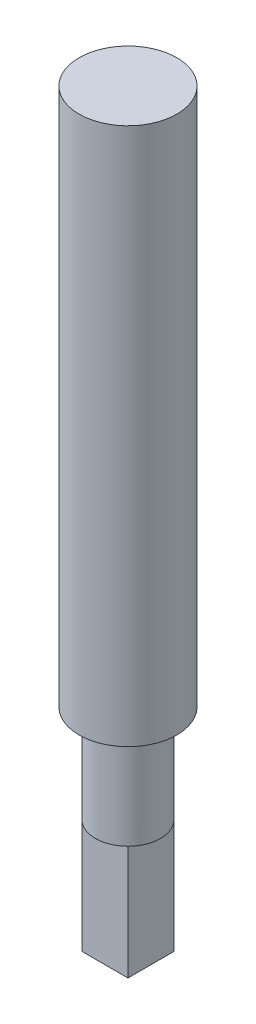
ISO-10303-21;
HEADER;
FILE_DESCRIPTION(('STEP AP214'),'2;1');
FILE_NAME('part.step','',(''),(''),'','','');
FILE_SCHEMA(('AUTOMOTIVE_DESIGN { 1 0 10303 214 1 1 1 1 }'));
ENDSEC;
DATA;
#1=APPLICATION_CONTEXT('core data for automotive mechanical design processes');
#2=APPLICATION_PROTOCOL_DEFINITION('international standard','automotive_design',2000,#1);
#3=PRODUCT_CONTEXT('',#1,'mechanical');
#4=PRODUCT('Part','Part','',(#3));
#5=PRODUCT_RELATED_PRODUCT_CATEGORY('part','',(#4));
#6=PRODUCT_DEFINITION_FORMATION('','',#4);
#7=PRODUCT_DEFINITION_CONTEXT('part definition',#1,'design');
#8=PRODUCT_DEFINITION('design','',#6,#7);
#9=PRODUCT_DEFINITION_SHAPE('','',#8);
#10=(LENGTH_UNIT() NAMED_UNIT(*) SI_UNIT(.MILLI.,.METRE.));
#11=(NAMED_UNIT(*) PLANE_ANGLE_UNIT() SI_UNIT($,.RADIAN.));
#12=(NAMED_UNIT(*) SI_UNIT($,.STERADIAN.) SOLID_ANGLE_UNIT());
#13=UNCERTAINTY_MEASURE_WITH_UNIT(LENGTH_MEASURE(1.E-05),#10,'distance_accuracy_value','');
#14=(GEOMETRIC_REPRESENTATION_CONTEXT(3) GLOBAL_UNCERTAINTY_ASSIGNED_CONTEXT((#13)) GLOBAL_UNIT_ASSIGNED_CONTEXT((#10,
#11,#12)) REPRESENTATION_CONTEXT('',''));
#15=CARTESIAN_POINT('',(0.,0.,0.));
#16=DIRECTION('',(0.,0.,1.));
#17=DIRECTION('',(1.,0.,0.));
#18=AXIS2_PLACEMENT_3D('',#15,#16,#17);
#19=CARTESIAN_POINT('',(1.50000000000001,-6.5,0.));
#20=DIRECTION('',(0.,1.,0.));
#21=DIRECTION('',(0.,0.,1.));
#22=AXIS2_PLACEMENT_3D('',#19,#20,#21);
#23=CYLINDRICAL_SURFACE('',#22,1.);
#24=CARTESIAN_POINT('',(1.50000000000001,0.,0.));
#25=DIRECTION('',(0.,1.,0.));
#26=DIRECTION('',(0.,0.,1.));
#27=AXIS2_PLACEMENT_3D('',#24,#25,#26);
#28=CIRCLE('',#27,1.);
#29=CARTESIAN_POINT('',(1.50000000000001,0.,0.999999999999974));
#30=VERTEX_POINT('',#29);
#31=EDGE_CURVE('E11',#30,#30,#28,.F.);
#32=ORIENTED_EDGE('',*,*,#31,.T.);
#33=EDGE_LOOP('',(#32));
#34=FACE_BOUND('',#33,.T.);
#35=CARTESIAN_POINT('',(1.50000000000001,-3.,0.));
#36=DIRECTION('',(0.,-1.,0.));
#37=DIRECTION('',(0.,0.,-1.));
#38=AXIS2_PLACEMENT_3D('',#35,#36,#37);
#39=CIRCLE('',#38,1.);
#40=CARTESIAN_POINT('',(2.20710678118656,-3.,-0.707106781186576));
#41=VERTEX_POINT('',#40);
#42=CARTESIAN_POINT('',(2.20710678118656,-3.,0.707106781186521));
#43=VERTEX_POINT('',#42);
#44=EDGE_CURVE('E119',#41,#43,#39,.T.);
#45=ORIENTED_EDGE('',*,*,#44,.F.);
#46=CARTESIAN_POINT('',(1.50000000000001,-3.,0.));
#47=DIRECTION('',(0.,-1.,0.));
#48=DIRECTION('',(0.,0.,-1.));
#49=AXIS2_PLACEMENT_3D('',#46,#47,#48);
#50=CIRCLE('',#49,1.);
#51=CARTESIAN_POINT('',(0.79289321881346,-3.,-0.707106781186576));
#52=VERTEX_POINT('',#51);
#53=EDGE_CURVE('E127',#52,#41,#50,.T.);
#54=ORIENTED_EDGE('',*,*,#53,.F.);
#55=CARTESIAN_POINT('',(1.50000000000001,-3.,0.));
#56=DIRECTION('',(0.,-1.,0.));
#57=DIRECTION('',(0.,0.,-1.));
#58=AXIS2_PLACEMENT_3D('',#55,#56,#57);
#59=CIRCLE('',#58,1.);
#60=CARTESIAN_POINT('',(0.79289321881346,-3.,0.707106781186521));
#61=VERTEX_POINT('',#60);
#62=EDGE_CURVE('E356',#61,#52,#59,.T.);
#63=ORIENTED_EDGE('',*,*,#62,.F.);
#64=CARTESIAN_POINT('',(1.50000000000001,-3.,0.));
#65=DIRECTION('',(0.,-1.,0.));
#66=DIRECTION('',(0.,0.,-1.));
#67=AXIS2_PLACEMENT_3D('',#64,#65,#66);
#68=CIRCLE('',#67,1.);
#69=EDGE_CURVE('E128',#43,#61,#68,.T.);
#70=ORIENTED_EDGE('',*,*,#69,.F.);
#71=EDGE_LOOP('',(#45,#54,#63,#70));
#72=FACE_BOUND('',#71,.T.);
#73=ADVANCED_FACE('F36',(#34,#72),#23,.T.);
#74=CARTESIAN_POINT('',(1.50000000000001,-6.5,0.));
#75=DIRECTION('',(0.,-1.,0.));
#76=DIRECTION('',(0.,0.,-1.));
#77=AXIS2_PLACEMENT_3D('',#74,#75,#76);
#78=PLANE('',#77);
#79=DIRECTION('',(-1.,0.,0.));
#80=VECTOR('',#79,1.);
#81=CARTESIAN_POINT('',(0.,-6.5,-0.707106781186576));
#82=LINE('',#81,#80);
#83=CARTESIAN_POINT('',(2.20710678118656,-6.5,-0.707106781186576));
#84=VERTEX_POINT('',#83);
#85=CARTESIAN_POINT('',(0.79289321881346,-6.5,-0.707106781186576));
#86=VERTEX_POINT('',#85);
#87=EDGE_CURVE('E133',#84,#86,#82,.T.);
#88=ORIENTED_EDGE('',*,*,#87,.F.);
#89=DIRECTION('',(0.,0.,1.));
#90=VECTOR('',#89,1.);
#91=CARTESIAN_POINT('',(2.20710678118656,-6.5,0.));
#92=LINE('',#91,#90);
#93=CARTESIAN_POINT('',(2.20710678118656,-6.5,0.707106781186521));
#94=VERTEX_POINT('',#93);
#95=EDGE_CURVE('E108',#84,#94,#92,.T.);
#96=ORIENTED_EDGE('',*,*,#95,.T.);
#97=DIRECTION('',(-1.,0.,0.));
#98=VECTOR('',#97,1.);
#99=CARTESIAN_POINT('',(0.,-6.5,0.707106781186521));
#100=LINE('',#99,#98);
#101=CARTESIAN_POINT('',(0.79289321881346,-6.5,0.707106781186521));
#102=VERTEX_POINT('',#101);
#103=EDGE_CURVE('E120',#94,#102,#100,.T.);
#104=ORIENTED_EDGE('',*,*,#103,.T.);
#105=DIRECTION('',(0.,0.,1.));
#106=VECTOR('',#105,1.);
#107=CARTESIAN_POINT('',(0.79289321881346,-6.5,0.));
#108=LINE('',#107,#106);
#109=EDGE_CURVE('E141',#86,#102,#108,.T.);
#110=ORIENTED_EDGE('',*,*,#109,.F.);
#111=EDGE_LOOP('',(#88,#96,#104,#110));
#112=FACE_BOUND('',#111,.T.);
#113=ADVANCED_FACE('F199',(#112),#78,.T.);
#114=CARTESIAN_POINT('',(1.5,0.,0.));
#115=DIRECTION('',(0.,1.,0.));
#116=DIRECTION('',(0.,0.,1.));
#117=AXIS2_PLACEMENT_3D('',#114,#115,#116);
#118=PLANE('',#117);
#119=CARTESIAN_POINT('',(1.5,0.,0.));
#120=DIRECTION('',(0.,1.,0.));
#121=DIRECTION('',(0.,0.,1.));
#122=AXIS2_PLACEMENT_3D('',#119,#120,#121);
#123=CIRCLE('',#122,1.5);
#124=CARTESIAN_POINT('',(1.5,0.,1.5));
#125=VERTEX_POINT('',#124);
#126=EDGE_CURVE('E156',#125,#125,#123,.T.);
#127=ORIENTED_EDGE('',*,*,#126,.F.);
#128=EDGE_LOOP('',(#127));
#129=FACE_BOUND('',#128,.T.);
#130=ORIENTED_EDGE('',*,*,#31,.F.);
#131=EDGE_LOOP('',(#130));
#132=FACE_BOUND('',#131,.T.);
#133=ADVANCED_FACE('F206',(#129,#132),#118,.F.);
#134=CARTESIAN_POINT('',(1.5,16.5,0.));
#135=DIRECTION('',(0.,-1.,0.));
#136=DIRECTION('',(0.,0.,-1.));
#137=AXIS2_PLACEMENT_3D('',#134,#135,#136);
#138=CYLINDRICAL_SURFACE('',#137,1.5);
#139=ORIENTED_EDGE('',*,*,#126,.T.);
#140=EDGE_LOOP('',(#139));
#141=FACE_BOUND('',#140,.T.);
#142=CARTESIAN_POINT('',(1.5,16.5,0.));
#143=DIRECTION('',(0.,1.,0.));
#144=DIRECTION('',(0.,0.,1.));
#145=AXIS2_PLACEMENT_3D('',#142,#143,#144);
#146=CIRCLE('',#145,1.5);
#147=CARTESIAN_POINT('',(1.5,16.5,1.5));
#148=VERTEX_POINT('',#147);
#149=EDGE_CURVE('E163',#148,#148,#146,.T.);
#150=ORIENTED_EDGE('',*,*,#149,.F.);
#151=EDGE_LOOP('',(#150));
#152=FACE_BOUND('',#151,.T.);
#153=CARTESIAN_POINT('',(1.5,7.50000000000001,0.));
#154=DIRECTION('',(0.,-1.,0.));
#155=DIRECTION('',(0.,0.,-1.));
#156=AXIS2_PLACEMENT_3D('',#153,#154,#155);
#157=CIRCLE('',#156,1.5);
#158=CARTESIAN_POINT('',(0.0857864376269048,7.50000000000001,0.5));
#159=VERTEX_POINT('',#158);
#160=CARTESIAN_POINT('',(0.0857864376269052,7.50000000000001,-0.5));
#161=VERTEX_POINT('',#160);
#162=EDGE_CURVE('E166',#159,#161,#157,.T.);
#163=ORIENTED_EDGE('',*,*,#162,.F.);
#164=DIRECTION('',(0.,-1.,0.));
#165=VECTOR('',#164,1.);
#166=CARTESIAN_POINT('',(0.0857864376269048,16.5,0.5));
#167=LINE('',#166,#165);
#168=CARTESIAN_POINT('',(0.0857864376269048,4.5,0.5));
#169=VERTEX_POINT('',#168);
#170=EDGE_CURVE('E44',#159,#169,#167,.T.);
#171=ORIENTED_EDGE('',*,*,#170,.T.);
#172=CARTESIAN_POINT('',(1.5,4.5,0.));
#173=DIRECTION('',(0.,-1.,0.));
#174=DIRECTION('',(0.,0.,-1.));
#175=AXIS2_PLACEMENT_3D('',#172,#173,#174);
#176=CIRCLE('',#175,1.5);
#177=CARTESIAN_POINT('',(0.0857864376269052,4.5,-0.5));
#178=VERTEX_POINT('',#177);
#179=EDGE_CURVE('E51',#169,#178,#176,.T.);
#180=ORIENTED_EDGE('',*,*,#179,.T.);
#181=DIRECTION('',(0.,-1.,0.));
#182=VECTOR('',#181,1.);
#183=CARTESIAN_POINT('',(0.0857864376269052,16.5,-0.5));
#184=LINE('',#183,#182);
#185=EDGE_CURVE('E59',#161,#178,#184,.T.);
#186=ORIENTED_EDGE('',*,*,#185,.F.);
#187=EDGE_LOOP('',(#163,#171,#180,#186));
#188=FACE_BOUND('',#187,.T.);
#189=ADVANCED_FACE('F38',(#141,#152,#188),#138,.T.);
#190=CARTESIAN_POINT('',(1.5,16.5,0.));
#191=DIRECTION('',(0.,1.,0.));
#192=DIRECTION('',(0.,0.,1.));
#193=AXIS2_PLACEMENT_3D('',#190,#191,#192);
#194=PLANE('',#193);
#195=ORIENTED_EDGE('',*,*,#149,.T.);
#196=EDGE_LOOP('',(#195));
#197=FACE_BOUND('',#196,.T.);
#198=ADVANCED_FACE('F195',(#197),#194,.T.);
#199=CARTESIAN_POINT('',(1.,4.5,-0.5));
#200=DIRECTION('',(0.,-1.,0.));
#201=DIRECTION('',(0.,0.,-1.));
#202=AXIS2_PLACEMENT_3D('',#199,#200,#201);
#203=PLANE('',#202);
#204=DIRECTION('',(-1.,0.,0.));
#205=VECTOR('',#204,1.);
#206=CARTESIAN_POINT('',(1.,4.5,0.5));
#207=LINE('',#206,#205);
#208=CARTESIAN_POINT('',(1.,4.5,0.5));
#209=VERTEX_POINT('',#208);
#210=EDGE_CURVE('E153',#209,#169,#207,.T.);
#211=ORIENTED_EDGE('',*,*,#210,.F.);
#212=DIRECTION('',(0.,0.,1.));
#213=VECTOR('',#212,1.);
#214=CARTESIAN_POINT('',(1.,4.5,-0.5));
#215=LINE('',#214,#213);
#216=CARTESIAN_POINT('',(1.,4.5,-0.5));
#217=VERTEX_POINT('',#216);
#218=EDGE_CURVE('E142',#217,#209,#215,.T.);
#219=ORIENTED_EDGE('',*,*,#218,.F.);
#220=DIRECTION('',(-1.,0.,0.));
#221=VECTOR('',#220,1.);
#222=CARTESIAN_POINT('',(1.,4.5,-0.5));
#223=LINE('',#222,#221);
#224=EDGE_CURVE('E154',#217,#178,#223,.T.);
#225=ORIENTED_EDGE('',*,*,#224,.T.);
#226=ORIENTED_EDGE('',*,*,#179,.F.);
#227=EDGE_LOOP('',(#211,#219,#225,#226));
#228=FACE_BOUND('',#227,.T.);
#229=ADVANCED_FACE('F186',(#228),#203,.F.);
#230=CARTESIAN_POINT('',(1.,4.5,-0.5));
#231=DIRECTION('',(0.,0.,1.));
#232=DIRECTION('',(1.,0.,0.));
#233=AXIS2_PLACEMENT_3D('',#230,#231,#232);
#234=PLANE('',#233);
#235=ORIENTED_EDGE('',*,*,#185,.T.);
#236=ORIENTED_EDGE('',*,*,#224,.F.);
#237=DIRECTION('',(0.,1.,0.));
#238=VECTOR('',#237,1.);
#239=CARTESIAN_POINT('',(1.,4.5,-0.5));
#240=LINE('',#239,#238);
#241=CARTESIAN_POINT('',(1.,7.50000000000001,-0.5));
#242=VERTEX_POINT('',#241);
#243=EDGE_CURVE('E151',#217,#242,#240,.T.);
#244=ORIENTED_EDGE('',*,*,#243,.T.);
#245=DIRECTION('',(-1.,0.,0.));
#246=VECTOR('',#245,1.);
#247=CARTESIAN_POINT('',(1.,7.50000000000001,-0.5));
#248=LINE('',#247,#246);
#249=EDGE_CURVE('E157',#242,#161,#248,.T.);
#250=ORIENTED_EDGE('',*,*,#249,.T.);
#251=EDGE_LOOP('',(#235,#236,#244,#250));
#252=FACE_BOUND('',#251,.T.);
#253=ADVANCED_FACE('F187',(#252),#234,.T.);
#254=CARTESIAN_POINT('',(1.,7.50000000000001,-0.5));
#255=DIRECTION('',(0.,-1.,0.));
#256=DIRECTION('',(0.,0.,-1.));
#257=AXIS2_PLACEMENT_3D('',#254,#255,#256);
#258=PLANE('',#257);
#259=DIRECTION('',(-1.,0.,0.));
#260=VECTOR('',#259,1.);
#261=CARTESIAN_POINT('',(1.,7.50000000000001,0.5));
#262=LINE('',#261,#260);
#263=CARTESIAN_POINT('',(1.,7.50000000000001,0.5));
#264=VERTEX_POINT('',#263);
#265=EDGE_CURVE('E159',#264,#159,#262,.T.);
#266=ORIENTED_EDGE('',*,*,#265,.T.);
#267=ORIENTED_EDGE('',*,*,#162,.T.);
#268=ORIENTED_EDGE('',*,*,#249,.F.);
#269=DIRECTION('',(0.,0.,1.));
#270=VECTOR('',#269,1.);
#271=CARTESIAN_POINT('',(1.,7.50000000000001,-0.5));
#272=LINE('',#271,#270);
#273=EDGE_CURVE('E149',#242,#264,#272,.T.);
#274=ORIENTED_EDGE('',*,*,#273,.T.);
#275=EDGE_LOOP('',(#266,#267,#268,#274));
#276=FACE_BOUND('',#275,.T.);
#277=ADVANCED_FACE('F179',(#276),#258,.T.);
#278=CARTESIAN_POINT('',(1.,4.5,0.5));
#279=DIRECTION('',(0.,0.,1.));
#280=DIRECTION('',(1.,0.,0.));
#281=AXIS2_PLACEMENT_3D('',#278,#279,#280);
#282=PLANE('',#281);
#283=ORIENTED_EDGE('',*,*,#265,.F.);
#284=DIRECTION('',(0.,1.,0.));
#285=VECTOR('',#284,1.);
#286=CARTESIAN_POINT('',(1.,4.5,0.5));
#287=LINE('',#286,#285);
#288=EDGE_CURVE('E146',#209,#264,#287,.T.);
#289=ORIENTED_EDGE('',*,*,#288,.F.);
#290=ORIENTED_EDGE('',*,*,#210,.T.);
#291=ORIENTED_EDGE('',*,*,#170,.F.);
#292=EDGE_LOOP('',(#283,#289,#290,#291));
#293=FACE_BOUND('',#292,.T.);
#294=ADVANCED_FACE('F176',(#293),#282,.F.);
#295=CARTESIAN_POINT('',(1.,0.,0.));
#296=DIRECTION('',(-1.,0.,0.));
#297=DIRECTION('',(0.,0.,1.));
#298=AXIS2_PLACEMENT_3D('',#295,#296,#297);
#299=PLANE('',#298);
#300=ORIENTED_EDGE('',*,*,#218,.T.);
#301=ORIENTED_EDGE('',*,*,#288,.T.);
#302=ORIENTED_EDGE('',*,*,#273,.F.);
#303=ORIENTED_EDGE('',*,*,#243,.F.);
#304=EDGE_LOOP('',(#300,#301,#302,#303));
#305=FACE_BOUND('',#304,.T.);
#306=ADVANCED_FACE('F184',(#305),#299,.T.);
#307=CARTESIAN_POINT('',(0.,-3.,-0.707106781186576));
#308=DIRECTION('',(0.,0.,1.));
#309=DIRECTION('',(1.,0.,0.));
#310=AXIS2_PLACEMENT_3D('',#307,#308,#309);
#311=PLANE('',#310);
#312=ORIENTED_EDGE('',*,*,#87,.T.);
#313=DIRECTION('',(0.,-1.,0.));
#314=VECTOR('',#313,1.);
#315=CARTESIAN_POINT('',(0.79289321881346,-3.,-0.707106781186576));
#316=LINE('',#315,#314);
#317=EDGE_CURVE('E113',#52,#86,#316,.T.);
#318=ORIENTED_EDGE('',*,*,#317,.F.);
#319=DIRECTION('',(-1.,0.,0.));
#320=VECTOR('',#319,1.);
#321=CARTESIAN_POINT('',(0.,-3.,-0.707106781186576));
#322=LINE('',#321,#320);
#323=EDGE_CURVE('E114',#41,#52,#322,.T.);
#324=ORIENTED_EDGE('',*,*,#323,.F.);
#325=DIRECTION('',(0.,-1.,0.));
#326=VECTOR('',#325,1.);
#327=CARTESIAN_POINT('',(2.20710678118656,-3.,-0.707106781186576));
#328=LINE('',#327,#326);
#329=EDGE_CURVE('E102',#41,#84,#328,.T.);
#330=ORIENTED_EDGE('',*,*,#329,.T.);
#331=EDGE_LOOP('',(#312,#318,#324,#330));
#332=FACE_BOUND('',#331,.T.);
#333=ADVANCED_FACE('F136',(#332),#311,.F.);
#334=CARTESIAN_POINT('',(0.,-3.,0.));
#335=DIRECTION('',(0.,-1.,0.));
#336=DIRECTION('',(0.,0.,-1.));
#337=AXIS2_PLACEMENT_3D('',#334,#335,#336);
#338=PLANE('',#337);
#339=ORIENTED_EDGE('',*,*,#53,.T.);
#340=ORIENTED_EDGE('',*,*,#323,.T.);
#341=EDGE_LOOP('',(#339,#340));
#342=FACE_BOUND('',#341,.T.);
#343=ADVANCED_FACE('F132',(#342),#338,.T.);
#344=CARTESIAN_POINT('',(0.79289321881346,-3.,0.));
#345=DIRECTION('',(1.,0.,0.));
#346=DIRECTION('',(0.,0.,-1.));
#347=AXIS2_PLACEMENT_3D('',#344,#345,#346);
#348=PLANE('',#347);
#349=ORIENTED_EDGE('',*,*,#109,.T.);
#350=DIRECTION('',(0.,-1.,0.));
#351=VECTOR('',#350,1.);
#352=CARTESIAN_POINT('',(0.79289321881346,-3.,0.707106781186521));
#353=LINE('',#352,#351);
#354=EDGE_CURVE('E364',#61,#102,#353,.T.);
#355=ORIENTED_EDGE('',*,*,#354,.F.);
#356=DIRECTION('',(0.,0.,1.));
#357=VECTOR('',#356,1.);
#358=CARTESIAN_POINT('',(0.79289321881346,-3.,0.));
#359=LINE('',#358,#357);
#360=EDGE_CURVE('E359',#52,#61,#359,.T.);
#361=ORIENTED_EDGE('',*,*,#360,.F.);
#362=ORIENTED_EDGE('',*,*,#317,.T.);
#363=EDGE_LOOP('',(#349,#355,#361,#362));
#364=FACE_BOUND('',#363,.T.);
#365=ADVANCED_FACE('F290',(#364),#348,.F.);
#366=CARTESIAN_POINT('',(0.,-3.,0.));
#367=DIRECTION('',(0.,-1.,0.));
#368=DIRECTION('',(0.,0.,-1.));
#369=AXIS2_PLACEMENT_3D('',#366,#367,#368);
#370=PLANE('',#369);
#371=ORIENTED_EDGE('',*,*,#62,.T.);
#372=ORIENTED_EDGE('',*,*,#360,.T.);
#373=EDGE_LOOP('',(#371,#372));
#374=FACE_BOUND('',#373,.T.);
#375=ADVANCED_FACE('F298',(#374),#370,.T.);
#376=CARTESIAN_POINT('',(0.,-3.,0.707106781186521));
#377=DIRECTION('',(0.,0.,1.));
#378=DIRECTION('',(1.,0.,0.));
#379=AXIS2_PLACEMENT_3D('',#376,#377,#378);
#380=PLANE('',#379);
#381=ORIENTED_EDGE('',*,*,#103,.F.);
#382=DIRECTION('',(0.,-1.,0.));
#383=VECTOR('',#382,1.);
#384=CARTESIAN_POINT('',(2.20710678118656,-3.,0.707106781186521));
#385=LINE('',#384,#383);
#386=EDGE_CURVE('E360',#43,#94,#385,.T.);
#387=ORIENTED_EDGE('',*,*,#386,.F.);
#388=DIRECTION('',(-1.,0.,0.));
#389=VECTOR('',#388,1.);
#390=CARTESIAN_POINT('',(0.,-3.,0.707106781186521));
#391=LINE('',#390,#389);
#392=EDGE_CURVE('E354',#43,#61,#391,.T.);
#393=ORIENTED_EDGE('',*,*,#392,.T.);
#394=ORIENTED_EDGE('',*,*,#354,.T.);
#395=EDGE_LOOP('',(#381,#387,#393,#394));
#396=FACE_BOUND('',#395,.T.);
#397=ADVANCED_FACE('F307',(#396),#380,.T.);
#398=CARTESIAN_POINT('',(0.,-3.,0.));
#399=DIRECTION('',(0.,-1.,0.));
#400=DIRECTION('',(0.,0.,-1.));
#401=AXIS2_PLACEMENT_3D('',#398,#399,#400);
#402=PLANE('',#401);
#403=ORIENTED_EDGE('',*,*,#392,.F.);
#404=ORIENTED_EDGE('',*,*,#69,.T.);
#405=EDGE_LOOP('',(#403,#404));
#406=FACE_BOUND('',#405,.T.);
#407=ADVANCED_FACE('F316',(#406),#402,.T.);
#408=CARTESIAN_POINT('',(2.20710678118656,-3.,0.));
#409=DIRECTION('',(1.,0.,0.));
#410=DIRECTION('',(0.,0.,-1.));
#411=AXIS2_PLACEMENT_3D('',#408,#409,#410);
#412=PLANE('',#411);
#413=ORIENTED_EDGE('',*,*,#95,.F.);
#414=ORIENTED_EDGE('',*,*,#329,.F.);
#415=DIRECTION('',(0.,0.,1.));
#416=VECTOR('',#415,1.);
#417=CARTESIAN_POINT('',(2.20710678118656,-3.,0.));
#418=LINE('',#417,#416);
#419=EDGE_CURVE('E105',#41,#43,#418,.T.);
#420=ORIENTED_EDGE('',*,*,#419,.T.);
#421=ORIENTED_EDGE('',*,*,#386,.T.);
#422=EDGE_LOOP('',(#413,#414,#420,#421));
#423=FACE_BOUND('',#422,.T.);
#424=ADVANCED_FACE('F104',(#423),#412,.T.);
#425=CARTESIAN_POINT('',(0.,-3.,0.));
#426=DIRECTION('',(0.,-1.,0.));
#427=DIRECTION('',(0.,0.,-1.));
#428=AXIS2_PLACEMENT_3D('',#425,#426,#427);
#429=PLANE('',#428);
#430=ORIENTED_EDGE('',*,*,#419,.F.);
#431=ORIENTED_EDGE('',*,*,#44,.T.);
#432=EDGE_LOOP('',(#430,#431));
#433=FACE_BOUND('',#432,.T.);
#434=ADVANCED_FACE('F118',(#433),#429,.T.);
#435=CLOSED_SHELL('',(#73,#113,#133,#189,#198,#229,#253,#277,#294,#306,#333,#343,#365,#375,#397,
#407,#424,#434));
#436=MANIFOLD_SOLID_BREP('B2',#435);
#437=ADVANCED_BREP_SHAPE_REPRESENTATION('',(#18,#436),#14);
#438=SHAPE_DEFINITION_REPRESENTATION(#9,#437);
ENDSEC;
END-ISO-10303-21;
